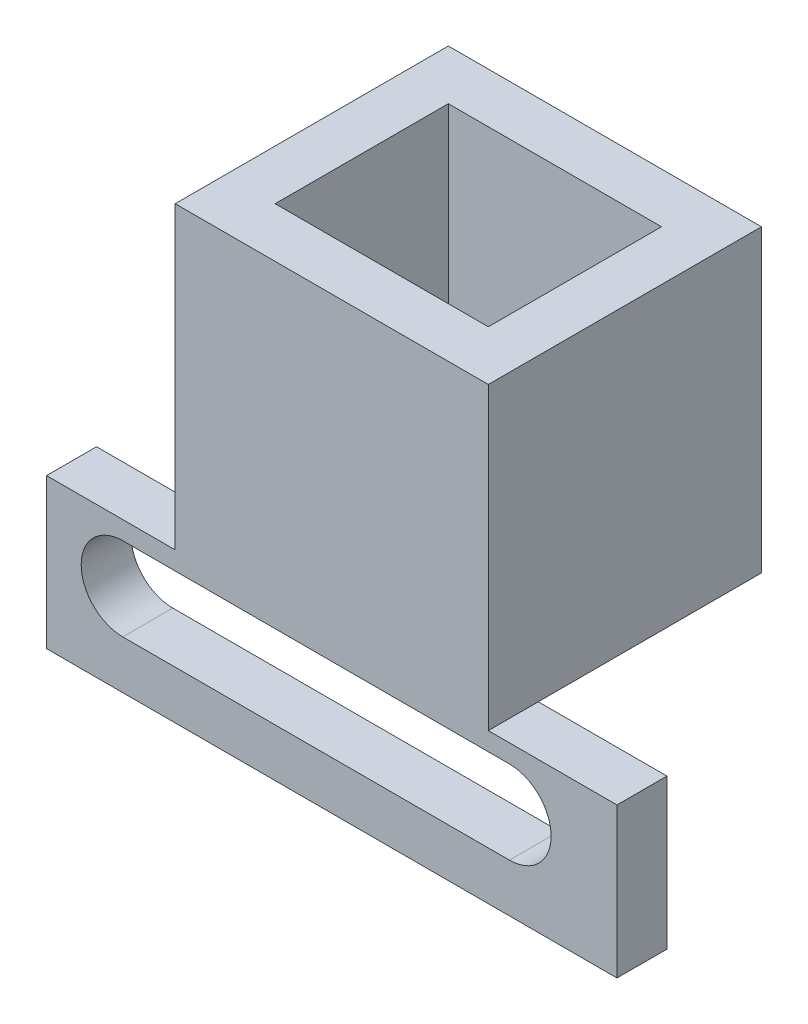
ISO-10303-21;
HEADER;
FILE_DESCRIPTION(('STEP AP214'),'2;1');
FILE_NAME('part.step','',(''),(''),'','','');
FILE_SCHEMA(('AUTOMOTIVE_DESIGN { 1 0 10303 214 1 1 1 1 }'));
ENDSEC;
DATA;
#1=APPLICATION_CONTEXT('core data for automotive mechanical design processes');
#2=APPLICATION_PROTOCOL_DEFINITION('international standard','automotive_design',2000,#1);
#3=PRODUCT_CONTEXT('',#1,'mechanical');
#4=PRODUCT('Part','Part','',(#3));
#5=PRODUCT_RELATED_PRODUCT_CATEGORY('part','',(#4));
#6=PRODUCT_DEFINITION_FORMATION('','',#4);
#7=PRODUCT_DEFINITION_CONTEXT('part definition',#1,'design');
#8=PRODUCT_DEFINITION('design','',#6,#7);
#9=PRODUCT_DEFINITION_SHAPE('','',#8);
#10=(LENGTH_UNIT() NAMED_UNIT(*) SI_UNIT(.MILLI.,.METRE.));
#11=(NAMED_UNIT(*) PLANE_ANGLE_UNIT() SI_UNIT($,.RADIAN.));
#12=(NAMED_UNIT(*) SI_UNIT($,.STERADIAN.) SOLID_ANGLE_UNIT());
#13=UNCERTAINTY_MEASURE_WITH_UNIT(LENGTH_MEASURE(1.E-05),#10,'distance_accuracy_value','');
#14=(GEOMETRIC_REPRESENTATION_CONTEXT(3) GLOBAL_UNCERTAINTY_ASSIGNED_CONTEXT((#13)) GLOBAL_UNIT_ASSIGNED_CONTEXT((#10,
#11,#12)) REPRESENTATION_CONTEXT('',''));
#15=CARTESIAN_POINT('',(0.,0.,0.));
#16=DIRECTION('',(0.,0.,1.));
#17=DIRECTION('',(1.,0.,0.));
#18=AXIS2_PLACEMENT_3D('',#15,#16,#17);
#19=CARTESIAN_POINT('',(51.0419177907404,0.,0.));
#20=DIRECTION('',(1.,0.,0.));
#21=DIRECTION('',(0.,0.,-1.));
#22=AXIS2_PLACEMENT_3D('',#19,#20,#21);
#23=PLANE('',#22);
#24=DIRECTION('',(0.,0.,-1.));
#25=VECTOR('',#24,1.);
#26=CARTESIAN_POINT('',(51.0419177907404,78.6,-60.4838042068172));
#27=LINE('',#26,#25);
#28=CARTESIAN_POINT('',(51.0419177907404,78.6,-73.6082089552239));
#29=VERTEX_POINT('',#28);
#30=CARTESIAN_POINT('',(51.0419177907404,78.6,-84.0082089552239));
#31=VERTEX_POINT('',#30);
#32=EDGE_CURVE('E254',#29,#31,#27,.T.);
#33=ORIENTED_EDGE('',*,*,#32,.T.);
#34=DIRECTION('',(0.,1.,0.));
#35=VECTOR('',#34,1.);
#36=CARTESIAN_POINT('',(51.0419177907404,0.,-84.0082089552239));
#37=LINE('',#36,#35);
#38=CARTESIAN_POINT('',(51.0419177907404,96.6,-84.0082089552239));
#39=VERTEX_POINT('',#38);
#40=EDGE_CURVE('E216',#31,#39,#37,.T.);
#41=ORIENTED_EDGE('',*,*,#40,.T.);
#42=DIRECTION('',(0.,0.,1.));
#43=VECTOR('',#42,1.);
#44=CARTESIAN_POINT('',(51.0419177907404,96.6,-70.6082089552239));
#45=LINE('',#44,#43);
#46=CARTESIAN_POINT('',(51.0419177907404,96.6,-73.6082089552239));
#47=VERTEX_POINT('',#46);
#48=EDGE_CURVE('E278',#39,#47,#45,.T.);
#49=ORIENTED_EDGE('',*,*,#48,.T.);
#50=DIRECTION('',(0.,-1.,0.));
#51=VECTOR('',#50,1.);
#52=CARTESIAN_POINT('',(51.0419177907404,0.,-73.6082089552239));
#53=LINE('',#52,#51);
#54=EDGE_CURVE('E267',#47,#29,#53,.T.);
#55=ORIENTED_EDGE('',*,*,#54,.T.);
#56=EDGE_LOOP('',(#33,#41,#49,#55));
#57=FACE_BOUND('',#56,.T.);
#58=ADVANCED_FACE('F46',(#57),#23,.T.);
#59=CARTESIAN_POINT('',(63.8419177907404,0.,0.));
#60=DIRECTION('',(-1.,0.,0.));
#61=DIRECTION('',(0.,0.,1.));
#62=AXIS2_PLACEMENT_3D('',#59,#60,#61);
#63=PLANE('',#62);
#64=DIRECTION('',(0.,0.,-1.));
#65=VECTOR('',#64,1.);
#66=CARTESIAN_POINT('',(63.8419177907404,96.6,-127.550100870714));
#67=LINE('',#66,#65);
#68=CARTESIAN_POINT('',(63.8419177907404,96.6,-73.6082089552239));
#69=VERTEX_POINT('',#68);
#70=CARTESIAN_POINT('',(63.8419177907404,96.6,-84.0082089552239));
#71=VERTEX_POINT('',#70);
#72=EDGE_CURVE('E64',#69,#71,#67,.T.);
#73=ORIENTED_EDGE('',*,*,#72,.T.);
#74=DIRECTION('',(0.,-1.,0.));
#75=VECTOR('',#74,1.);
#76=CARTESIAN_POINT('',(63.8419177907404,0.,-84.0082089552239));
#77=LINE('',#76,#75);
#78=CARTESIAN_POINT('',(63.8419177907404,78.6,-84.0082089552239));
#79=VERTEX_POINT('',#78);
#80=EDGE_CURVE('E210',#71,#79,#77,.T.);
#81=ORIENTED_EDGE('',*,*,#80,.T.);
#82=DIRECTION('',(0.,0.,-1.));
#83=VECTOR('',#82,1.);
#84=CARTESIAN_POINT('',(63.8419177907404,78.6,-60.4838042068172));
#85=LINE('',#84,#83);
#86=CARTESIAN_POINT('',(63.8419177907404,78.6,-73.6082089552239));
#87=VERTEX_POINT('',#86);
#88=EDGE_CURVE('E237',#87,#79,#85,.T.);
#89=ORIENTED_EDGE('',*,*,#88,.F.);
#90=DIRECTION('',(0.,1.,0.));
#91=VECTOR('',#90,1.);
#92=CARTESIAN_POINT('',(63.8419177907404,0.,-73.6082089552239));
#93=LINE('',#92,#91);
#94=EDGE_CURVE('E264',#87,#69,#93,.T.);
#95=ORIENTED_EDGE('',*,*,#94,.T.);
#96=EDGE_LOOP('',(#73,#81,#89,#95));
#97=FACE_BOUND('',#96,.T.);
#98=ADVANCED_FACE('F404',(#97),#63,.T.);
#99=CARTESIAN_POINT('',(48.0419177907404,78.6,-70.6072089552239));
#100=DIRECTION('',(1.,0.,0.));
#101=DIRECTION('',(0.,0.,-1.));
#102=AXIS2_PLACEMENT_3D('',#99,#100,#101);
#103=PLANE('',#102);
#104=DIRECTION('',(0.,0.,-1.));
#105=VECTOR('',#104,1.);
#106=CARTESIAN_POINT('',(48.0419177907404,96.6,-70.6072089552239));
#107=LINE('',#106,#105);
#108=CARTESIAN_POINT('',(48.0419177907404,96.6,-70.6082089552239));
#109=VERTEX_POINT('',#108);
#110=CARTESIAN_POINT('',(48.0419177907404,96.6,-87.0082089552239));
#111=VERTEX_POINT('',#110);
#112=EDGE_CURVE('E180',#109,#111,#107,.T.);
#113=ORIENTED_EDGE('',*,*,#112,.T.);
#114=DIRECTION('',(0.,1.,0.));
#115=VECTOR('',#114,1.);
#116=CARTESIAN_POINT('',(48.0419177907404,96.6,-87.0082089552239));
#117=LINE('',#116,#115);
#118=CARTESIAN_POINT('',(48.0419177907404,78.6,-87.0082089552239));
#119=VERTEX_POINT('',#118);
#120=EDGE_CURVE('E192',#119,#111,#117,.T.);
#121=ORIENTED_EDGE('',*,*,#120,.F.);
#122=DIRECTION('',(0.,0.,-1.));
#123=VECTOR('',#122,1.);
#124=CARTESIAN_POINT('',(48.0419177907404,78.6,-70.6072089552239));
#125=LINE('',#124,#123);
#126=CARTESIAN_POINT('',(48.0419177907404,78.6,-73.6082089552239));
#127=VERTEX_POINT('',#126);
#128=EDGE_CURVE('E187',#127,#119,#125,.T.);
#129=ORIENTED_EDGE('',*,*,#128,.F.);
#130=DIRECTION('',(0.,0.,-1.));
#131=VECTOR('',#130,1.);
#132=CARTESIAN_POINT('',(48.0419177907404,78.6,-70.6072089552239));
#133=LINE('',#132,#131);
#134=CARTESIAN_POINT('',(48.0419177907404,78.6,-70.6082089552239));
#135=VERTEX_POINT('',#134);
#136=EDGE_CURVE('E242',#135,#127,#133,.T.);
#137=ORIENTED_EDGE('',*,*,#136,.F.);
#138=DIRECTION('',(0.,-1.,0.));
#139=VECTOR('',#138,1.);
#140=CARTESIAN_POINT('',(48.0419177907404,78.6,-70.6082089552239));
#141=LINE('',#140,#139);
#142=EDGE_CURVE('E226',#109,#135,#141,.T.);
#143=ORIENTED_EDGE('',*,*,#142,.F.);
#144=EDGE_LOOP('',(#113,#121,#129,#137,#143));
#145=FACE_BOUND('',#144,.T.);
#146=ADVANCED_FACE('F386',(#145),#103,.F.);
#147=CARTESIAN_POINT('',(66.8419177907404,96.6,-70.6072089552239));
#148=DIRECTION('',(-1.,0.,0.));
#149=DIRECTION('',(0.,0.,1.));
#150=AXIS2_PLACEMENT_3D('',#147,#148,#149);
#151=PLANE('',#150);
#152=DIRECTION('',(0.,0.,-1.));
#153=VECTOR('',#152,1.);
#154=CARTESIAN_POINT('',(66.8419177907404,78.6,-70.6072089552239));
#155=LINE('',#154,#153);
#156=CARTESIAN_POINT('',(66.8419177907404,78.6,-73.6082089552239));
#157=VERTEX_POINT('',#156);
#158=CARTESIAN_POINT('',(66.8419177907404,78.6,-87.0082089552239));
#159=VERTEX_POINT('',#158);
#160=EDGE_CURVE('E169',#157,#159,#155,.T.);
#161=ORIENTED_EDGE('',*,*,#160,.T.);
#162=DIRECTION('',(0.,-1.,0.));
#163=VECTOR('',#162,1.);
#164=CARTESIAN_POINT('',(66.8419177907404,96.6,-87.0082089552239));
#165=LINE('',#164,#163);
#166=CARTESIAN_POINT('',(66.8419177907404,96.6,-87.0082089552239));
#167=VERTEX_POINT('',#166);
#168=EDGE_CURVE('E173',#167,#159,#165,.T.);
#169=ORIENTED_EDGE('',*,*,#168,.F.);
#170=DIRECTION('',(0.,0.,-1.));
#171=VECTOR('',#170,1.);
#172=CARTESIAN_POINT('',(66.8419177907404,96.6,-70.6072089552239));
#173=LINE('',#172,#171);
#174=CARTESIAN_POINT('',(66.8419177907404,96.6,-70.6082089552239));
#175=VERTEX_POINT('',#174);
#176=EDGE_CURVE('E179',#175,#167,#173,.T.);
#177=ORIENTED_EDGE('',*,*,#176,.F.);
#178=DIRECTION('',(0.,1.,0.));
#179=VECTOR('',#178,1.);
#180=CARTESIAN_POINT('',(66.8419177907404,96.6,-70.6082089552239));
#181=LINE('',#180,#179);
#182=CARTESIAN_POINT('',(66.8419177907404,78.6,-70.6082089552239));
#183=VERTEX_POINT('',#182);
#184=EDGE_CURVE('E221',#183,#175,#181,.T.);
#185=ORIENTED_EDGE('',*,*,#184,.F.);
#186=DIRECTION('',(0.,0.,-1.));
#187=VECTOR('',#186,1.);
#188=CARTESIAN_POINT('',(66.8419177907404,78.6,-70.6072089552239));
#189=LINE('',#188,#187);
#190=EDGE_CURVE('E175',#183,#157,#189,.T.);
#191=ORIENTED_EDGE('',*,*,#190,.T.);
#192=EDGE_LOOP('',(#161,#169,#177,#185,#191));
#193=FACE_BOUND('',#192,.T.);
#194=ADVANCED_FACE('F171',(#193),#151,.F.);
#195=CARTESIAN_POINT('',(40.3169177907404,78.6,-127.550100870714));
#196=DIRECTION('',(0.,1.,0.));
#197=DIRECTION('',(0.,0.,1.));
#198=AXIS2_PLACEMENT_3D('',#195,#196,#197);
#199=PLANE('',#198);
#200=ORIENTED_EDGE('',*,*,#128,.T.);
#201=DIRECTION('',(-1.,0.,0.));
#202=VECTOR('',#201,1.);
#203=CARTESIAN_POINT('',(66.8419177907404,78.6,-87.0082089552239));
#204=LINE('',#203,#202);
#205=EDGE_CURVE('E183',#159,#119,#204,.T.);
#206=ORIENTED_EDGE('',*,*,#205,.F.);
#207=ORIENTED_EDGE('',*,*,#160,.F.);
#208=DIRECTION('',(1.,0.,0.));
#209=VECTOR('',#208,1.);
#210=CARTESIAN_POINT('',(74.5669177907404,78.6,-73.6082089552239));
#211=LINE('',#210,#209);
#212=EDGE_CURVE('E335',#87,#157,#211,.T.);
#213=ORIENTED_EDGE('',*,*,#212,.F.);
#214=ORIENTED_EDGE('',*,*,#88,.T.);
#215=DIRECTION('',(-1.,0.,0.));
#216=VECTOR('',#215,1.);
#217=CARTESIAN_POINT('',(66.8419177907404,78.6,-84.0082089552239));
#218=LINE('',#217,#216);
#219=EDGE_CURVE('E203',#79,#31,#218,.T.);
#220=ORIENTED_EDGE('',*,*,#219,.T.);
#221=ORIENTED_EDGE('',*,*,#32,.F.);
#222=EDGE_CURVE('E336',#127,#29,#211,.T.);
#223=ORIENTED_EDGE('',*,*,#222,.F.);
#224=EDGE_LOOP('',(#200,#206,#207,#213,#214,#220,#221,#223));
#225=FACE_BOUND('',#224,.T.);
#226=ADVANCED_FACE('F184',(#225),#199,.F.);
#227=CARTESIAN_POINT('',(74.5669177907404,96.6,-127.550100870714));
#228=DIRECTION('',(0.,-1.,0.));
#229=DIRECTION('',(0.,0.,-1.));
#230=AXIS2_PLACEMENT_3D('',#227,#228,#229);
#231=PLANE('',#230);
#232=ORIENTED_EDGE('',*,*,#176,.T.);
#233=DIRECTION('',(1.,0.,0.));
#234=VECTOR('',#233,1.);
#235=CARTESIAN_POINT('',(66.8419177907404,96.6,-87.0082089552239));
#236=LINE('',#235,#234);
#237=EDGE_CURVE('E197',#111,#167,#236,.T.);
#238=ORIENTED_EDGE('',*,*,#237,.F.);
#239=ORIENTED_EDGE('',*,*,#112,.F.);
#240=DIRECTION('',(1.,0.,0.));
#241=VECTOR('',#240,1.);
#242=CARTESIAN_POINT('',(74.5669177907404,96.6,-70.6082089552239));
#243=LINE('',#242,#241);
#244=EDGE_CURVE('E50',#109,#175,#243,.T.);
#245=ORIENTED_EDGE('',*,*,#244,.T.);
#246=EDGE_LOOP('',(#232,#238,#239,#245));
#247=FACE_BOUND('',#246,.T.);
#248=ORIENTED_EDGE('',*,*,#48,.F.);
#249=DIRECTION('',(1.,0.,0.));
#250=VECTOR('',#249,1.);
#251=CARTESIAN_POINT('',(66.8419177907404,96.6,-84.0082089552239));
#252=LINE('',#251,#250);
#253=EDGE_CURVE('E199',#39,#71,#252,.T.);
#254=ORIENTED_EDGE('',*,*,#253,.T.);
#255=ORIENTED_EDGE('',*,*,#72,.F.);
#256=DIRECTION('',(1.,0.,0.));
#257=VECTOR('',#256,1.);
#258=CARTESIAN_POINT('',(40.3169177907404,96.6,-73.6082089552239));
#259=LINE('',#258,#257);
#260=EDGE_CURVE('E257',#47,#69,#259,.T.);
#261=ORIENTED_EDGE('',*,*,#260,.F.);
#262=EDGE_LOOP('',(#248,#254,#255,#261));
#263=FACE_BOUND('',#262,.T.);
#264=ADVANCED_FACE('F48',(#247,#263),#231,.F.);
#265=CARTESIAN_POINT('',(74.5669177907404,78.6,-127.550100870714));
#266=DIRECTION('',(-1.,0.,0.));
#267=DIRECTION('',(0.,0.,1.));
#268=AXIS2_PLACEMENT_3D('',#265,#266,#267);
#269=PLANE('',#268);
#270=DIRECTION('',(0.,-1.,0.));
#271=VECTOR('',#270,1.);
#272=CARTESIAN_POINT('',(74.5669177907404,78.6,-73.6082089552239));
#273=LINE('',#272,#271);
#274=CARTESIAN_POINT('',(74.5669177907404,78.6,-73.6082089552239));
#275=VERTEX_POINT('',#274);
#276=CARTESIAN_POINT('',(74.5669177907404,69.6,-73.6082089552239));
#277=VERTEX_POINT('',#276);
#278=EDGE_CURVE('E325',#275,#277,#273,.T.);
#279=ORIENTED_EDGE('',*,*,#278,.F.);
#280=DIRECTION('',(0.,0.,-1.));
#281=VECTOR('',#280,1.);
#282=CARTESIAN_POINT('',(74.5669177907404,78.6,-70.6072089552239));
#283=LINE('',#282,#281);
#284=CARTESIAN_POINT('',(74.5669177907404,78.6,-70.6082089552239));
#285=VERTEX_POINT('',#284);
#286=EDGE_CURVE('E72',#285,#275,#283,.T.);
#287=ORIENTED_EDGE('',*,*,#286,.F.);
#288=DIRECTION('',(0.,-1.,0.));
#289=VECTOR('',#288,1.);
#290=CARTESIAN_POINT('',(74.5669177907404,78.6,-70.6082089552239));
#291=LINE('',#290,#289);
#292=CARTESIAN_POINT('',(74.5669177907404,69.6,-70.6082089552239));
#293=VERTEX_POINT('',#292);
#294=EDGE_CURVE('E56',#285,#293,#291,.T.);
#295=ORIENTED_EDGE('',*,*,#294,.T.);
#296=DIRECTION('',(0.,0.,1.));
#297=VECTOR('',#296,1.);
#298=CARTESIAN_POINT('',(74.5669177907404,69.6,-73.6082089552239));
#299=LINE('',#298,#297);
#300=EDGE_CURVE('E347',#277,#293,#299,.T.);
#301=ORIENTED_EDGE('',*,*,#300,.F.);
#302=EDGE_LOOP('',(#279,#287,#295,#301));
#303=FACE_BOUND('',#302,.T.);
#304=ADVANCED_FACE('F394',(#303),#269,.F.);
#305=CARTESIAN_POINT('',(40.3169177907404,96.6,-127.550100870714));
#306=DIRECTION('',(1.,0.,0.));
#307=DIRECTION('',(0.,1.,0.));
#308=AXIS2_PLACEMENT_3D('',#305,#306,#307);
#309=PLANE('',#308);
#310=DIRECTION('',(0.,1.,0.));
#311=VECTOR('',#310,1.);
#312=CARTESIAN_POINT('',(40.3169177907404,96.6,-70.6082089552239));
#313=LINE('',#312,#311);
#314=CARTESIAN_POINT('',(40.3169177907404,69.6,-70.6082089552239));
#315=VERTEX_POINT('',#314);
#316=CARTESIAN_POINT('',(40.3169177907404,78.6,-70.6082089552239));
#317=VERTEX_POINT('',#316);
#318=EDGE_CURVE('E12',#315,#317,#313,.T.);
#319=ORIENTED_EDGE('',*,*,#318,.T.);
#320=DIRECTION('',(0.,0.,-1.));
#321=VECTOR('',#320,1.);
#322=CARTESIAN_POINT('',(40.3169177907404,78.6,-70.6072089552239));
#323=LINE('',#322,#321);
#324=CARTESIAN_POINT('',(40.3169177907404,78.6,-73.6082089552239));
#325=VERTEX_POINT('',#324);
#326=EDGE_CURVE('E241',#317,#325,#323,.T.);
#327=ORIENTED_EDGE('',*,*,#326,.T.);
#328=DIRECTION('',(0.,1.,0.));
#329=VECTOR('',#328,1.);
#330=CARTESIAN_POINT('',(40.3169177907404,78.6,-73.6082089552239));
#331=LINE('',#330,#329);
#332=CARTESIAN_POINT('',(40.3169177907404,69.6,-73.6082089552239));
#333=VERTEX_POINT('',#332);
#334=EDGE_CURVE('E331',#333,#325,#331,.T.);
#335=ORIENTED_EDGE('',*,*,#334,.F.);
#336=DIRECTION('',(0.,0.,1.));
#337=VECTOR('',#336,1.);
#338=CARTESIAN_POINT('',(40.3169177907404,69.6,-73.6082089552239));
#339=LINE('',#338,#337);
#340=EDGE_CURVE('E340',#333,#315,#339,.T.);
#341=ORIENTED_EDGE('',*,*,#340,.T.);
#342=EDGE_LOOP('',(#319,#327,#335,#341));
#343=FACE_BOUND('',#342,.T.);
#344=ADVANCED_FACE('F389',(#343),#309,.F.);
#345=CARTESIAN_POINT('',(0.,0.,-70.6082089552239));
#346=DIRECTION('',(0.,0.,1.));
#347=DIRECTION('',(1.,0.,0.));
#348=AXIS2_PLACEMENT_3D('',#345,#346,#347);
#349=PLANE('',#348);
#350=ORIENTED_EDGE('',*,*,#184,.T.);
#351=ORIENTED_EDGE('',*,*,#244,.F.);
#352=ORIENTED_EDGE('',*,*,#142,.T.);
#353=DIRECTION('',(-1.,0.,0.));
#354=VECTOR('',#353,1.);
#355=CARTESIAN_POINT('',(48.0419177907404,78.6,-70.6082089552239));
#356=LINE('',#355,#354);
#357=EDGE_CURVE('E220',#135,#317,#356,.T.);
#358=ORIENTED_EDGE('',*,*,#357,.T.);
#359=ORIENTED_EDGE('',*,*,#318,.F.);
#360=DIRECTION('',(-1.,0.,0.));
#361=VECTOR('',#360,1.);
#362=CARTESIAN_POINT('',(74.5669177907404,69.6,-70.6082089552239));
#363=LINE('',#362,#361);
#364=EDGE_CURVE('E324',#293,#315,#363,.T.);
#365=ORIENTED_EDGE('',*,*,#364,.F.);
#366=ORIENTED_EDGE('',*,*,#294,.F.);
#367=DIRECTION('',(-1.,0.,0.));
#368=VECTOR('',#367,1.);
#369=CARTESIAN_POINT('',(74.5669177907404,78.6,-70.6082089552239));
#370=LINE('',#369,#368);
#371=EDGE_CURVE('E231',#285,#183,#370,.T.);
#372=ORIENTED_EDGE('',*,*,#371,.T.);
#373=EDGE_LOOP('',(#350,#351,#352,#358,#359,#365,#366,#372));
#374=FACE_BOUND('',#373,.T.);
#375=CARTESIAN_POINT('',(68.1119402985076,75.,-70.6082089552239));
#376=DIRECTION('',(0.,0.,-1.));
#377=DIRECTION('',(-1.,0.,0.));
#378=AXIS2_PLACEMENT_3D('',#375,#376,#377);
#379=CIRCLE('',#378,2.49999999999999);
#380=CARTESIAN_POINT('',(68.1119402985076,77.5,-70.6082089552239));
#381=VERTEX_POINT('',#380);
#382=CARTESIAN_POINT('',(68.1119402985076,72.5,-70.6082089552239));
#383=VERTEX_POINT('',#382);
#384=EDGE_CURVE('E281',#381,#383,#379,.T.);
#385=ORIENTED_EDGE('',*,*,#384,.T.);
#386=DIRECTION('',(-1.,0.,0.));
#387=VECTOR('',#386,1.);
#388=CARTESIAN_POINT('',(68.1119402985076,72.5,-70.6082089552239));
#389=LINE('',#388,#387);
#390=CARTESIAN_POINT('',(44.8968282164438,72.5,-70.6082089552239));
#391=VERTEX_POINT('',#390);
#392=EDGE_CURVE('E300',#383,#391,#389,.T.);
#393=ORIENTED_EDGE('',*,*,#392,.T.);
#394=CARTESIAN_POINT('',(44.8968282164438,75.,-70.6082089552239));
#395=DIRECTION('',(0.,0.,-1.));
#396=DIRECTION('',(-1.,0.,0.));
#397=AXIS2_PLACEMENT_3D('',#394,#395,#396);
#398=CIRCLE('',#397,2.49999999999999);
#399=CARTESIAN_POINT('',(44.8968282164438,77.5,-70.6082089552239));
#400=VERTEX_POINT('',#399);
#401=EDGE_CURVE('E304',#391,#400,#398,.T.);
#402=ORIENTED_EDGE('',*,*,#401,.T.);
#403=DIRECTION('',(1.,0.,0.));
#404=VECTOR('',#403,1.);
#405=CARTESIAN_POINT('',(68.1119402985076,77.5,-70.6082089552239));
#406=LINE('',#405,#404);
#407=EDGE_CURVE('E286',#400,#381,#406,.T.);
#408=ORIENTED_EDGE('',*,*,#407,.T.);
#409=EDGE_LOOP('',(#385,#393,#402,#408));
#410=FACE_BOUND('',#409,.T.);
#411=ADVANCED_FACE('F362',(#374,#410),#349,.T.);
#412=CARTESIAN_POINT('',(0.,0.,-73.6082089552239));
#413=DIRECTION('',(0.,0.,-1.));
#414=DIRECTION('',(-1.,0.,0.));
#415=AXIS2_PLACEMENT_3D('',#412,#413,#414);
#416=PLANE('',#415);
#417=DIRECTION('',(-1.,0.,0.));
#418=VECTOR('',#417,1.);
#419=CARTESIAN_POINT('',(74.5669177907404,78.6,-73.6082089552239));
#420=LINE('',#419,#418);
#421=EDGE_CURVE('E225',#275,#157,#420,.T.);
#422=ORIENTED_EDGE('',*,*,#421,.F.);
#423=ORIENTED_EDGE('',*,*,#278,.T.);
#424=DIRECTION('',(-1.,0.,0.));
#425=VECTOR('',#424,1.);
#426=CARTESIAN_POINT('',(74.5669177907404,69.6,-73.6082089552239));
#427=LINE('',#426,#425);
#428=EDGE_CURVE('E328',#277,#333,#427,.T.);
#429=ORIENTED_EDGE('',*,*,#428,.T.);
#430=ORIENTED_EDGE('',*,*,#334,.T.);
#431=DIRECTION('',(-1.,0.,0.));
#432=VECTOR('',#431,1.);
#433=CARTESIAN_POINT('',(48.0419177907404,78.6,-73.6082089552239));
#434=LINE('',#433,#432);
#435=EDGE_CURVE('E245',#127,#325,#434,.T.);
#436=ORIENTED_EDGE('',*,*,#435,.F.);
#437=ORIENTED_EDGE('',*,*,#222,.T.);
#438=ORIENTED_EDGE('',*,*,#54,.F.);
#439=ORIENTED_EDGE('',*,*,#260,.T.);
#440=ORIENTED_EDGE('',*,*,#94,.F.);
#441=ORIENTED_EDGE('',*,*,#212,.T.);
#442=EDGE_LOOP('',(#422,#423,#429,#430,#436,#437,#438,#439,#440,#441));
#443=FACE_BOUND('',#442,.T.);
#444=DIRECTION('',(-1.,0.,0.));
#445=VECTOR('',#444,1.);
#446=CARTESIAN_POINT('',(68.1119402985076,72.5,-73.6082089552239));
#447=LINE('',#446,#445);
#448=CARTESIAN_POINT('',(68.1119402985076,72.5,-73.6082089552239));
#449=VERTEX_POINT('',#448);
#450=CARTESIAN_POINT('',(44.8968282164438,72.5,-73.6082089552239));
#451=VERTEX_POINT('',#450);
#452=EDGE_CURVE('E285',#449,#451,#447,.T.);
#453=ORIENTED_EDGE('',*,*,#452,.F.);
#454=CARTESIAN_POINT('',(68.1119402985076,75.,-73.6082089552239));
#455=DIRECTION('',(0.,0.,-1.));
#456=DIRECTION('',(-1.,0.,0.));
#457=AXIS2_PLACEMENT_3D('',#454,#455,#456);
#458=CIRCLE('',#457,2.49999999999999);
#459=CARTESIAN_POINT('',(68.1119402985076,77.5,-73.6082089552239));
#460=VERTEX_POINT('',#459);
#461=EDGE_CURVE('E282',#460,#449,#458,.T.);
#462=ORIENTED_EDGE('',*,*,#461,.F.);
#463=DIRECTION('',(1.,0.,0.));
#464=VECTOR('',#463,1.);
#465=CARTESIAN_POINT('',(68.1119402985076,77.5,-73.6082089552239));
#466=LINE('',#465,#464);
#467=CARTESIAN_POINT('',(44.8968282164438,77.5,-73.6082089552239));
#468=VERTEX_POINT('',#467);
#469=EDGE_CURVE('E293',#468,#460,#466,.T.);
#470=ORIENTED_EDGE('',*,*,#469,.F.);
#471=CARTESIAN_POINT('',(44.8968282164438,75.,-73.6082089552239));
#472=DIRECTION('',(0.,0.,-1.));
#473=DIRECTION('',(-1.,0.,0.));
#474=AXIS2_PLACEMENT_3D('',#471,#472,#473);
#475=CIRCLE('',#474,2.49999999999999);
#476=EDGE_CURVE('E289',#451,#468,#475,.T.);
#477=ORIENTED_EDGE('',*,*,#476,.F.);
#478=EDGE_LOOP('',(#453,#462,#470,#477));
#479=FACE_BOUND('',#478,.T.);
#480=ADVANCED_FACE('F368',(#443,#479),#416,.T.);
#481=CARTESIAN_POINT('',(74.5669177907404,69.6,-73.6082089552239));
#482=DIRECTION('',(0.,1.,0.));
#483=DIRECTION('',(0.,0.,1.));
#484=AXIS2_PLACEMENT_3D('',#481,#482,#483);
#485=PLANE('',#484);
#486=ORIENTED_EDGE('',*,*,#364,.T.);
#487=ORIENTED_EDGE('',*,*,#340,.F.);
#488=ORIENTED_EDGE('',*,*,#428,.F.);
#489=ORIENTED_EDGE('',*,*,#300,.T.);
#490=EDGE_LOOP('',(#486,#487,#488,#489));
#491=FACE_BOUND('',#490,.T.);
#492=ADVANCED_FACE('F393',(#491),#485,.F.);
#493=CARTESIAN_POINT('',(68.1119402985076,75.,-73.6082089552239));
#494=DIRECTION('',(0.,0.,1.));
#495=DIRECTION('',(1.,0.,0.));
#496=AXIS2_PLACEMENT_3D('',#493,#494,#495);
#497=CYLINDRICAL_SURFACE('',#496,2.49999999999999);
#498=ORIENTED_EDGE('',*,*,#384,.F.);
#499=DIRECTION('',(0.,0.,1.));
#500=VECTOR('',#499,1.);
#501=CARTESIAN_POINT('',(68.1119402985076,77.5,-73.6082089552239));
#502=LINE('',#501,#500);
#503=EDGE_CURVE('E296',#460,#381,#502,.T.);
#504=ORIENTED_EDGE('',*,*,#503,.F.);
#505=ORIENTED_EDGE('',*,*,#461,.T.);
#506=DIRECTION('',(0.,0.,1.));
#507=VECTOR('',#506,1.);
#508=CARTESIAN_POINT('',(68.1119402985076,72.5,-73.6082089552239));
#509=LINE('',#508,#507);
#510=EDGE_CURVE('E320',#449,#383,#509,.T.);
#511=ORIENTED_EDGE('',*,*,#510,.T.);
#512=EDGE_LOOP('',(#498,#504,#505,#511));
#513=FACE_BOUND('',#512,.T.);
#514=ADVANCED_FACE('F423',(#513),#497,.F.);
#515=CARTESIAN_POINT('',(68.1119402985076,72.5,-73.6082089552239));
#516=DIRECTION('',(0.,1.,0.));
#517=DIRECTION('',(0.,0.,1.));
#518=AXIS2_PLACEMENT_3D('',#515,#516,#517);
#519=PLANE('',#518);
#520=ORIENTED_EDGE('',*,*,#392,.F.);
#521=ORIENTED_EDGE('',*,*,#510,.F.);
#522=ORIENTED_EDGE('',*,*,#452,.T.);
#523=DIRECTION('',(0.,0.,1.));
#524=VECTOR('',#523,1.);
#525=CARTESIAN_POINT('',(44.8968282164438,72.5,-73.6082089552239));
#526=LINE('',#525,#524);
#527=EDGE_CURVE('E317',#451,#391,#526,.T.);
#528=ORIENTED_EDGE('',*,*,#527,.T.);
#529=EDGE_LOOP('',(#520,#521,#522,#528));
#530=FACE_BOUND('',#529,.T.);
#531=ADVANCED_FACE('F419',(#530),#519,.T.);
#532=CARTESIAN_POINT('',(44.8968282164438,75.,-73.6082089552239));
#533=DIRECTION('',(0.,0.,1.));
#534=DIRECTION('',(1.,0.,0.));
#535=AXIS2_PLACEMENT_3D('',#532,#533,#534);
#536=CYLINDRICAL_SURFACE('',#535,2.49999999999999);
#537=ORIENTED_EDGE('',*,*,#401,.F.);
#538=ORIENTED_EDGE('',*,*,#527,.F.);
#539=ORIENTED_EDGE('',*,*,#476,.T.);
#540=DIRECTION('',(0.,0.,1.));
#541=VECTOR('',#540,1.);
#542=CARTESIAN_POINT('',(44.8968282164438,77.5,-73.6082089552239));
#543=LINE('',#542,#541);
#544=EDGE_CURVE('E314',#468,#400,#543,.T.);
#545=ORIENTED_EDGE('',*,*,#544,.T.);
#546=EDGE_LOOP('',(#537,#538,#539,#545));
#547=FACE_BOUND('',#546,.T.);
#548=ADVANCED_FACE('F415',(#547),#536,.F.);
#549=CARTESIAN_POINT('',(68.1119402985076,77.5,-73.6082089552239));
#550=DIRECTION('',(0.,-1.,0.));
#551=DIRECTION('',(0.,0.,-1.));
#552=AXIS2_PLACEMENT_3D('',#549,#550,#551);
#553=PLANE('',#552);
#554=ORIENTED_EDGE('',*,*,#407,.F.);
#555=ORIENTED_EDGE('',*,*,#544,.F.);
#556=ORIENTED_EDGE('',*,*,#469,.T.);
#557=ORIENTED_EDGE('',*,*,#503,.T.);
#558=EDGE_LOOP('',(#554,#555,#556,#557));
#559=FACE_BOUND('',#558,.T.);
#560=ADVANCED_FACE('F413',(#559),#553,.T.);
#561=CARTESIAN_POINT('',(48.0419177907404,78.6,-70.6072089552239));
#562=DIRECTION('',(0.,-1.,0.));
#563=DIRECTION('',(0.,0.,-1.));
#564=AXIS2_PLACEMENT_3D('',#561,#562,#563);
#565=PLANE('',#564);
#566=ORIENTED_EDGE('',*,*,#136,.T.);
#567=ORIENTED_EDGE('',*,*,#435,.T.);
#568=ORIENTED_EDGE('',*,*,#326,.F.);
#569=ORIENTED_EDGE('',*,*,#357,.F.);
#570=EDGE_LOOP('',(#566,#567,#568,#569));
#571=FACE_BOUND('',#570,.T.);
#572=ADVANCED_FACE('F387',(#571),#565,.F.);
#573=CARTESIAN_POINT('',(74.5669177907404,78.6,-70.6072089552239));
#574=DIRECTION('',(0.,-1.,0.));
#575=DIRECTION('',(0.,0.,-1.));
#576=AXIS2_PLACEMENT_3D('',#573,#574,#575);
#577=PLANE('',#576);
#578=ORIENTED_EDGE('',*,*,#286,.T.);
#579=ORIENTED_EDGE('',*,*,#421,.T.);
#580=ORIENTED_EDGE('',*,*,#190,.F.);
#581=ORIENTED_EDGE('',*,*,#371,.F.);
#582=EDGE_LOOP('',(#578,#579,#580,#581));
#583=FACE_BOUND('',#582,.T.);
#584=ADVANCED_FACE('F364',(#583),#577,.F.);
#585=CARTESIAN_POINT('',(0.,0.,-87.0082089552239));
#586=DIRECTION('',(0.,0.,-1.));
#587=DIRECTION('',(-1.,0.,0.));
#588=AXIS2_PLACEMENT_3D('',#585,#586,#587);
#589=PLANE('',#588);
#590=ORIENTED_EDGE('',*,*,#168,.T.);
#591=ORIENTED_EDGE('',*,*,#205,.T.);
#592=ORIENTED_EDGE('',*,*,#120,.T.);
#593=ORIENTED_EDGE('',*,*,#237,.T.);
#594=EDGE_LOOP('',(#590,#591,#592,#593));
#595=FACE_BOUND('',#594,.T.);
#596=ADVANCED_FACE('F195',(#595),#589,.T.);
#597=CARTESIAN_POINT('',(0.,0.,-84.0082089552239));
#598=DIRECTION('',(0.,0.,-1.));
#599=DIRECTION('',(-1.,0.,0.));
#600=AXIS2_PLACEMENT_3D('',#597,#598,#599);
#601=PLANE('',#600);
#602=ORIENTED_EDGE('',*,*,#40,.F.);
#603=ORIENTED_EDGE('',*,*,#219,.F.);
#604=ORIENTED_EDGE('',*,*,#80,.F.);
#605=ORIENTED_EDGE('',*,*,#253,.F.);
#606=EDGE_LOOP('',(#602,#603,#604,#605));
#607=FACE_BOUND('',#606,.T.);
#608=ADVANCED_FACE('F376',(#607),#601,.F.);
#609=CLOSED_SHELL('',(#58,#98,#146,#194,#226,#264,#304,#344,#411,#480,#492,#514,#531,#548,#560,
#572,#584,#596,#608));
#610=MANIFOLD_SOLID_BREP('B2',#609);
#611=ADVANCED_BREP_SHAPE_REPRESENTATION('',(#18,#610),#14);
#612=SHAPE_DEFINITION_REPRESENTATION(#9,#611);
ENDSEC;
END-ISO-10303-21;
